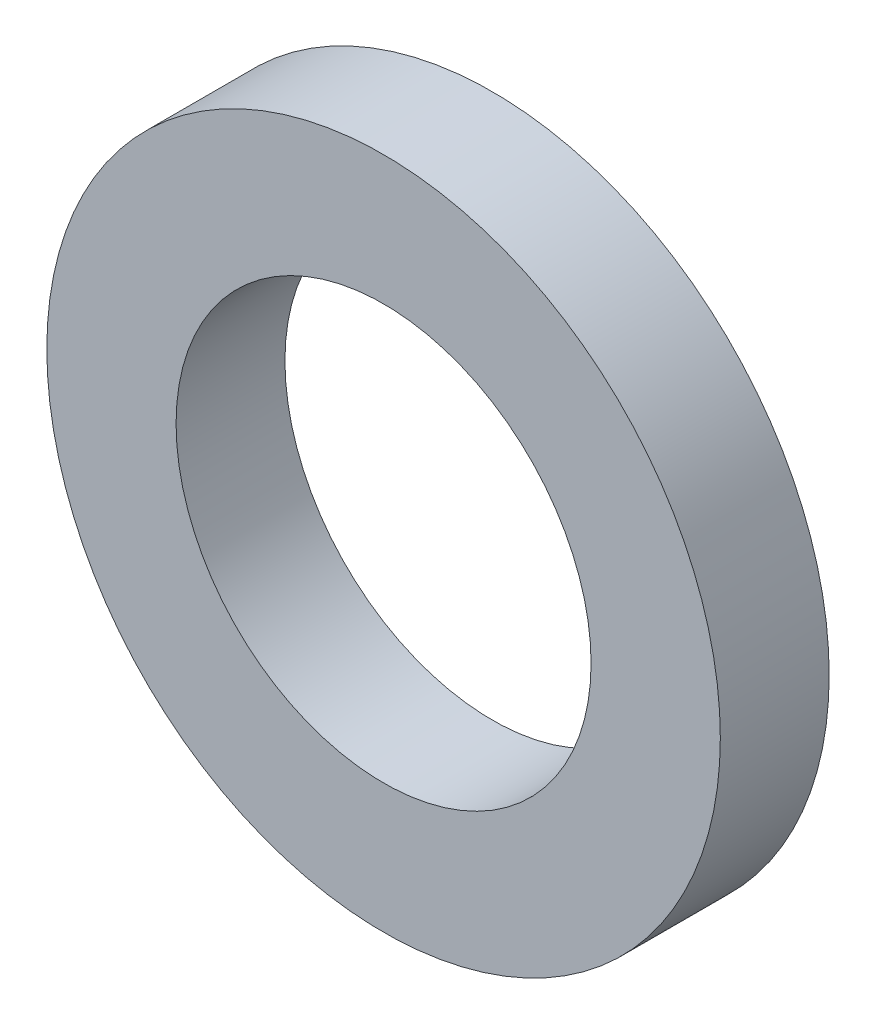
ISO-10303-21;
HEADER;
FILE_DESCRIPTION(('STEP AP214'),'2;1');
FILE_NAME('part.step','',(''),(''),'','','');
FILE_SCHEMA(('AUTOMOTIVE_DESIGN { 1 0 10303 214 1 1 1 1 }'));
ENDSEC;
DATA;
#1=APPLICATION_CONTEXT('core data for automotive mechanical design processes');
#2=APPLICATION_PROTOCOL_DEFINITION('international standard','automotive_design',2000,#1);
#3=PRODUCT_CONTEXT('',#1,'mechanical');
#4=PRODUCT('Part','Part','',(#3));
#5=PRODUCT_RELATED_PRODUCT_CATEGORY('part','',(#4));
#6=PRODUCT_DEFINITION_FORMATION('','',#4);
#7=PRODUCT_DEFINITION_CONTEXT('part definition',#1,'design');
#8=PRODUCT_DEFINITION('design','',#6,#7);
#9=PRODUCT_DEFINITION_SHAPE('','',#8);
#10=(LENGTH_UNIT() NAMED_UNIT(*) SI_UNIT(.MILLI.,.METRE.));
#11=(NAMED_UNIT(*) PLANE_ANGLE_UNIT() SI_UNIT($,.RADIAN.));
#12=(NAMED_UNIT(*) SI_UNIT($,.STERADIAN.) SOLID_ANGLE_UNIT());
#13=UNCERTAINTY_MEASURE_WITH_UNIT(LENGTH_MEASURE(1.E-05),#10,'distance_accuracy_value','');
#14=(GEOMETRIC_REPRESENTATION_CONTEXT(3) GLOBAL_UNCERTAINTY_ASSIGNED_CONTEXT((#13)) GLOBAL_UNIT_ASSIGNED_CONTEXT((#10,
#11,#12)) REPRESENTATION_CONTEXT('',''));
#15=CARTESIAN_POINT('',(0.,0.,0.));
#16=DIRECTION('',(0.,0.,1.));
#17=DIRECTION('',(1.,0.,0.));
#18=AXIS2_PLACEMENT_3D('',#15,#16,#17);
#19=CARTESIAN_POINT('',(0.,0.,-15.6007142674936));
#20=DIRECTION('',(0.,0.,1.));
#21=DIRECTION('',(1.,0.,0.));
#22=AXIS2_PLACEMENT_3D('',#19,#20,#21);
#23=CYLINDRICAL_SURFACE('',#22,4.95);
#24=CARTESIAN_POINT('',(0.,0.,-1.6));
#25=DIRECTION('',(0.,0.,1.));
#26=DIRECTION('',(1.,0.,0.));
#27=AXIS2_PLACEMENT_3D('',#24,#25,#26);
#28=CIRCLE('',#27,4.95);
#29=CARTESIAN_POINT('',(4.95,0.,-1.6));
#30=VERTEX_POINT('',#29);
#31=EDGE_CURVE('E38',#30,#30,#28,.F.);
#32=ORIENTED_EDGE('',*,*,#31,.F.);
#33=EDGE_LOOP('',(#32));
#34=FACE_BOUND('',#33,.T.);
#35=CARTESIAN_POINT('',(0.,0.,0.));
#36=DIRECTION('',(0.,0.,1.));
#37=DIRECTION('',(1.,0.,0.));
#38=AXIS2_PLACEMENT_3D('',#35,#36,#37);
#39=CIRCLE('',#38,4.95);
#40=CARTESIAN_POINT('',(4.95,0.,0.));
#41=VERTEX_POINT('',#40);
#42=EDGE_CURVE('E42',#41,#41,#39,.T.);
#43=ORIENTED_EDGE('',*,*,#42,.F.);
#44=EDGE_LOOP('',(#43));
#45=FACE_BOUND('',#44,.T.);
#46=ADVANCED_FACE('F32',(#34,#45),#23,.T.);
#47=CARTESIAN_POINT('',(0.,0.,0.));
#48=DIRECTION('',(0.,0.,1.));
#49=DIRECTION('',(1.,0.,0.));
#50=AXIS2_PLACEMENT_3D('',#47,#48,#49);
#51=PLANE('',#50);
#52=CARTESIAN_POINT('',(0.,0.,0.));
#53=DIRECTION('',(0.,0.,1.));
#54=DIRECTION('',(1.,0.,0.));
#55=AXIS2_PLACEMENT_3D('',#52,#53,#54);
#56=CIRCLE('',#55,3.05);
#57=CARTESIAN_POINT('',(3.05,0.,0.));
#58=VERTEX_POINT('',#57);
#59=EDGE_CURVE('E47',#58,#58,#56,.T.);
#60=ORIENTED_EDGE('',*,*,#59,.F.);
#61=EDGE_LOOP('',(#60));
#62=FACE_BOUND('',#61,.T.);
#63=ORIENTED_EDGE('',*,*,#42,.T.);
#64=EDGE_LOOP('',(#63));
#65=FACE_BOUND('',#64,.T.);
#66=ADVANCED_FACE('F54',(#62,#65),#51,.T.);
#67=CARTESIAN_POINT('',(0.,0.,-15.6007142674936));
#68=DIRECTION('',(0.,0.,1.));
#69=DIRECTION('',(1.,0.,0.));
#70=AXIS2_PLACEMENT_3D('',#67,#68,#69);
#71=CYLINDRICAL_SURFACE('',#70,3.05);
#72=CARTESIAN_POINT('',(0.,0.,-1.6));
#73=DIRECTION('',(0.,0.,1.));
#74=DIRECTION('',(1.,0.,0.));
#75=AXIS2_PLACEMENT_3D('',#72,#73,#74);
#76=CIRCLE('',#75,3.05);
#77=CARTESIAN_POINT('',(3.05,0.,-1.6));
#78=VERTEX_POINT('',#77);
#79=EDGE_CURVE('E10',#78,#78,#76,.F.);
#80=ORIENTED_EDGE('',*,*,#79,.T.);
#81=EDGE_LOOP('',(#80));
#82=FACE_BOUND('',#81,.T.);
#83=ORIENTED_EDGE('',*,*,#59,.T.);
#84=EDGE_LOOP('',(#83));
#85=FACE_BOUND('',#84,.T.);
#86=ADVANCED_FACE('F52',(#82,#85),#71,.F.);
#87=CARTESIAN_POINT('',(0.,0.,-1.6));
#88=DIRECTION('',(0.,0.,1.));
#89=DIRECTION('',(1.,0.,0.));
#90=AXIS2_PLACEMENT_3D('',#87,#88,#89);
#91=PLANE('',#90);
#92=ORIENTED_EDGE('',*,*,#31,.T.);
#93=EDGE_LOOP('',(#92));
#94=FACE_BOUND('',#93,.T.);
#95=ORIENTED_EDGE('',*,*,#79,.F.);
#96=EDGE_LOOP('',(#95));
#97=FACE_BOUND('',#96,.T.);
#98=ADVANCED_FACE('F73',(#94,#97),#91,.F.);
#99=CLOSED_SHELL('',(#46,#66,#86,#98));
#100=MANIFOLD_SOLID_BREP('B2',#99);
#101=ADVANCED_BREP_SHAPE_REPRESENTATION('',(#18,#100),#14);
#102=SHAPE_DEFINITION_REPRESENTATION(#9,#101);
ENDSEC;
END-ISO-10303-21;
